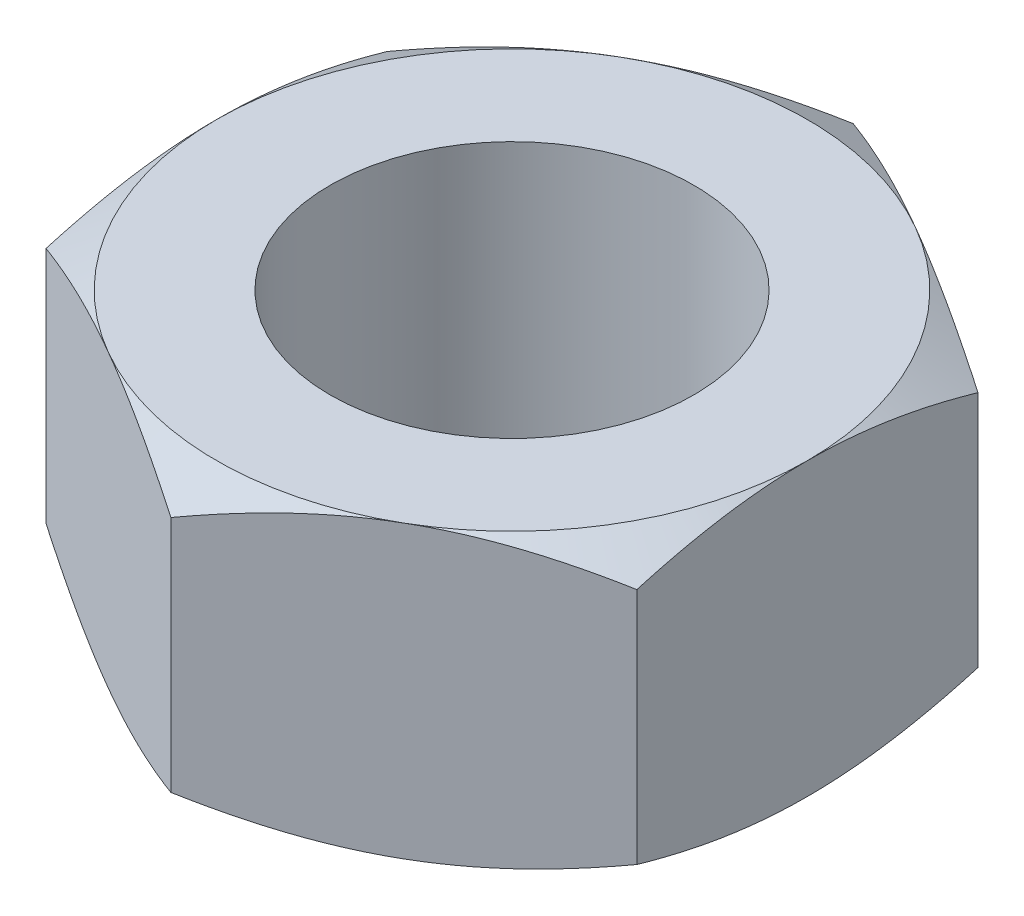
ISO-10303-21;
HEADER;
FILE_DESCRIPTION(('STEP AP214'),'2;1');
FILE_NAME('part.step','',(''),(''),'','','');
FILE_SCHEMA(('AUTOMOTIVE_DESIGN { 1 0 10303 214 1 1 1 1 }'));
ENDSEC;
DATA;
#1=APPLICATION_CONTEXT('core data for automotive mechanical design processes');
#2=APPLICATION_PROTOCOL_DEFINITION('international standard','automotive_design',2000,#1);
#3=PRODUCT_CONTEXT('',#1,'mechanical');
#4=PRODUCT('Part','Part','',(#3));
#5=PRODUCT_RELATED_PRODUCT_CATEGORY('part','',(#4));
#6=PRODUCT_DEFINITION_FORMATION('','',#4);
#7=PRODUCT_DEFINITION_CONTEXT('part definition',#1,'design');
#8=PRODUCT_DEFINITION('design','',#6,#7);
#9=PRODUCT_DEFINITION_SHAPE('','',#8);
#10=(LENGTH_UNIT() NAMED_UNIT(*) SI_UNIT(.MILLI.,.METRE.));
#11=(NAMED_UNIT(*) PLANE_ANGLE_UNIT() SI_UNIT($,.RADIAN.));
#12=(NAMED_UNIT(*) SI_UNIT($,.STERADIAN.) SOLID_ANGLE_UNIT());
#13=UNCERTAINTY_MEASURE_WITH_UNIT(LENGTH_MEASURE(1.E-05),#10,'distance_accuracy_value','');
#14=(GEOMETRIC_REPRESENTATION_CONTEXT(3) GLOBAL_UNCERTAINTY_ASSIGNED_CONTEXT((#13)) GLOBAL_UNIT_ASSIGNED_CONTEXT((#10,
#11,#12)) REPRESENTATION_CONTEXT('',''));
#15=CARTESIAN_POINT('',(0.,0.,0.));
#16=DIRECTION('',(0.,0.,1.));
#17=DIRECTION('',(1.,0.,0.));
#18=AXIS2_PLACEMENT_3D('',#15,#16,#17);
#19=CARTESIAN_POINT('',(0.,6.4,0.));
#20=DIRECTION('',(0.,-1.,0.));
#21=DIRECTION('',(0.,0.,-1.));
#22=AXIS2_PLACEMENT_3D('',#19,#20,#21);
#23=CONICAL_SURFACE('',#22,6.49999999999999,1.0471975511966);
#24=CARTESIAN_POINT('',(0.,6.4,0.));
#25=DIRECTION('',(0.,1.,0.));
#26=DIRECTION('',(0.,0.,1.));
#27=AXIS2_PLACEMENT_3D('',#24,#25,#26);
#28=CIRCLE('',#27,6.49999999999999);
#29=CARTESIAN_POINT('',(-3.24999999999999,6.4,-5.62916512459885));
#30=VERTEX_POINT('',#29);
#31=CARTESIAN_POINT('',(-6.5,6.4,0.));
#32=VERTEX_POINT('',#31);
#33=EDGE_CURVE('E145',#30,#32,#28,.T.);
#34=ORIENTED_EDGE('',*,*,#33,.F.);
#35=CARTESIAN_POINT('',(0.000200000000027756,5.81937674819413,-7.50566896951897));
#36=CARTESIAN_POINT('',(-0.142677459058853,5.86699557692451,-7.4231786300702));
#37=CARTESIAN_POINT('',(-0.286087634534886,5.91245329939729,-7.34038072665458));
#38=CARTESIAN_POINT('',(-0.574072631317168,5.99845131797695,-7.17411251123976));
#39=CARTESIAN_POINT('',(-0.718647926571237,6.03898949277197,-7.09064192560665));
#40=CARTESIAN_POINT('',(-1.15468865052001,6.15242899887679,-6.83889369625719));
#41=CARTESIAN_POINT('',(-1.44787528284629,6.21695219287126,-6.66962231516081));
#42=CARTESIAN_POINT('',(-1.88662374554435,6.29261341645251,-6.41631077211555));
#43=CARTESIAN_POINT('',(-2.03087463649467,6.31416714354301,-6.33302748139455));
#44=CARTESIAN_POINT('',(-2.32002821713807,6.35030968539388,-6.16608458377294));
#45=CARTESIAN_POINT('',(-2.46493084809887,6.36489911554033,-6.08242501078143));
#46=CARTESIAN_POINT('',(-2.7549877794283,6.38674124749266,-5.91496056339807));
#47=CARTESIAN_POINT('',(-2.90014160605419,6.39400227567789,-5.83115596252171));
#48=CARTESIAN_POINT('',(-3.19057533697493,6.40103969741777,-5.66347396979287));
#49=CARTESIAN_POINT('',(-3.33585523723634,6.4008163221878,-5.57959658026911));
#50=CARTESIAN_POINT('',(-3.73387594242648,6.38991654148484,-5.34979921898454));
#51=CARTESIAN_POINT('',(-3.98648646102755,6.37161818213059,-5.20395446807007));
#52=CARTESIAN_POINT('',(-4.49002967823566,6.31359365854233,-4.91323365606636));
#53=CARTESIAN_POINT('',(-4.74096060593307,6.27384766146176,-4.76835861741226));
#54=CARTESIAN_POINT('',(-5.24551722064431,6.17449409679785,-4.47705272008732));
#55=CARTESIAN_POINT('',(-5.49907924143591,6.11446557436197,-4.33065861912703));
#56=CARTESIAN_POINT('',(-6.00242193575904,5.97822500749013,-4.04005357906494));
#57=CARTESIAN_POINT('',(-6.25220905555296,5.9020449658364,-3.89583891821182));
#58=CARTESIAN_POINT('',(-6.5002,5.81937674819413,-3.75266127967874));
#59=B_SPLINE_CURVE_WITH_KNOTS('',3,(#35,#36,#37,#38,#39,#40,#41,#42,#43,#44,#45,#46,#47,#48,#49,
#50,#51,#52,#53,#54,#55,#56,#57,#58),.UNSPECIFIED.,.F.,.F.,(4,2,2,2,2,2,2,2,2,2,2,4),(0.,
0.515105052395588,1.03043143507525,2.06322554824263,2.56697389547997,3.07067772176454,
3.57380860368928,4.07692394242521,4.95279354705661,5.82947446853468,6.72559912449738,
7.61996451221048),.UNSPECIFIED.);
#60=CARTESIAN_POINT('',(-6.5,5.81944341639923,-3.75277674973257));
#61=VERTEX_POINT('',#60);
#62=EDGE_CURVE('E167',#30,#61,#59,.T.);
#63=ORIENTED_EDGE('',*,*,#62,.T.);
#64=CARTESIAN_POINT('',(-6.5,-1.73168432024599,-19.5312888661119));
#65=CARTESIAN_POINT('',(-6.5,-1.4966456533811,-19.1022078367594));
#66=CARTESIAN_POINT('',(-6.5,-1.26217643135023,-18.6728135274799));
#67=CARTESIAN_POINT('',(-6.5,-0.794676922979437,-17.8132347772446));
#68=CARTESIAN_POINT('',(-6.5,-0.561646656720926,-17.3830503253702));
#69=CARTESIAN_POINT('',(-6.5,-0.0971986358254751,-16.521492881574));
#70=CARTESIAN_POINT('',(-6.5,0.134218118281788,-16.0901193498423));
#71=CARTESIAN_POINT('',(-6.5,0.594879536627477,-15.2262161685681));
#72=CARTESIAN_POINT('',(-6.5,0.824124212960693,-14.7936865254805));
#73=CARTESIAN_POINT('',(-6.5,1.28560408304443,-13.91631497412));
#74=CARTESIAN_POINT('',(-6.5,1.51776990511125,-13.4714365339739));
#75=CARTESIAN_POINT('',(-6.5,1.97840703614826,-12.5797711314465));
#76=CARTESIAN_POINT('',(-6.5,2.20687837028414,-12.1329841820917));
#77=CARTESIAN_POINT('',(-6.5,2.65890746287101,-11.2370666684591));
#78=CARTESIAN_POINT('',(-6.5,2.88246642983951,-10.7879367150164));
#79=CARTESIAN_POINT('',(-6.5,3.32306396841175,-9.88649083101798));
#80=CARTESIAN_POINT('',(-6.5,3.54010276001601,-9.43417500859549));
#81=CARTESIAN_POINT('',(-6.5,3.86493666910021,-8.73959288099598));
#82=CARTESIAN_POINT('',(-6.5,3.97598724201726,-8.49884937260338));
#83=CARTESIAN_POINT('',(-6.5,4.19504629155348,-8.01598409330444));
#84=CARTESIAN_POINT('',(-6.5,4.30305482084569,-7.7738623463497));
#85=CARTESIAN_POINT('',(-6.5,4.51543794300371,-7.28793346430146));
#86=CARTESIAN_POINT('',(-6.5,4.61981135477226,-7.04412581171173));
#87=CARTESIAN_POINT('',(-6.5,4.82408998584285,-6.5546411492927));
#88=CARTESIAN_POINT('',(-6.5,4.92399522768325,-6.3089641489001));
#89=CARTESIAN_POINT('',(-6.5,5.1177530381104,-5.81692116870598));
#90=CARTESIAN_POINT('',(-6.5,5.21163822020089,-5.57056808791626));
#91=CARTESIAN_POINT('',(-6.5,5.39276680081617,-5.07540981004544));
#92=CARTESIAN_POINT('',(-6.5,5.48000993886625,-4.82660451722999));
#93=CARTESIAN_POINT('',(-6.5,5.64628709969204,-4.32633203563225));
#94=CARTESIAN_POINT('',(-6.5,5.72532385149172,-4.07486576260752));
#95=CARTESIAN_POINT('',(-6.5,5.8733538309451,-3.56902457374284));
#96=CARTESIAN_POINT('',(-6.5,5.9423482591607,-3.3146500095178));
#97=CARTESIAN_POINT('',(-6.5,6.09286933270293,-2.7022859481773));
#98=CARTESIAN_POINT('',(-6.5,6.16867912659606,-2.34283110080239));
#99=CARTESIAN_POINT('',(-6.5,6.26005263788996,-1.79997420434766));
#100=CARTESIAN_POINT('',(-6.5,6.28678595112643,-1.61842117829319));
#101=CARTESIAN_POINT('',(-6.5,6.33214270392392,-1.25431349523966));
#102=CARTESIAN_POINT('',(-6.5,6.35076724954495,-1.07175897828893));
#103=CARTESIAN_POINT('',(-6.5,6.37932032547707,-0.706738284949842));
#104=CARTESIAN_POINT('',(-6.5,6.38928503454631,-0.524274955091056));
#105=CARTESIAN_POINT('',(-6.5,6.40035260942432,-0.159079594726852));
#106=CARTESIAN_POINT('',(-6.49999999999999,6.40145560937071,0.0236524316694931));
#107=CARTESIAN_POINT('',(-6.49999999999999,6.39476456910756,0.388974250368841));
#108=CARTESIAN_POINT('',(-6.49999999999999,6.38696948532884,0.571564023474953));
#109=CARTESIAN_POINT('',(-6.49999999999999,6.36271981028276,0.936166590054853));
#110=CARTESIAN_POINT('',(-6.49999999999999,6.34626483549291,1.11817935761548));
#111=CARTESIAN_POINT('',(-6.49999999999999,6.29791455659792,1.54525292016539));
#112=CARTESIAN_POINT('',(-6.49999999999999,6.26262175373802,1.78993183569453));
#113=CARTESIAN_POINT('',(-6.49999999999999,6.17867090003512,2.27698296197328));
#114=CARTESIAN_POINT('',(-6.49999999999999,6.1300107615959,2.51935480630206));
#115=CARTESIAN_POINT('',(-6.49999999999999,6.02115869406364,3.00169016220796));
#116=CARTESIAN_POINT('',(-6.49999999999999,5.96095675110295,3.24165139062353));
#117=CARTESIAN_POINT('',(-6.49999999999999,5.83089363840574,3.71891050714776));
#118=CARTESIAN_POINT('',(-6.49999999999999,5.76103269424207,3.95620845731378));
#119=CARTESIAN_POINT('',(-6.49999999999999,5.61163566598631,4.43362654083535));
#120=CARTESIAN_POINT('',(-6.49999999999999,5.53191635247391,4.6736889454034));
#121=CARTESIAN_POINT('',(-6.49999999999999,5.36561577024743,5.15141149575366));
#122=CARTESIAN_POINT('',(-6.49999999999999,5.27903446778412,5.38907162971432));
#123=CARTESIAN_POINT('',(-6.49999999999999,5.10029080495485,5.86215143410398));
#124=CARTESIAN_POINT('',(-6.49999999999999,5.0081310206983,6.09757208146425));
#125=CARTESIAN_POINT('',(-6.49999999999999,4.86643002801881,6.44929602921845));
#126=CARTESIAN_POINT('',(-6.49999999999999,4.81862003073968,6.56630154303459));
#127=CARTESIAN_POINT('',(-6.49999999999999,4.72194822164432,6.79987674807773));
#128=CARTESIAN_POINT('',(-6.49999999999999,4.67308641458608,6.91644644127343));
#129=CARTESIAN_POINT('',(-6.49999999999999,4.50320382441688,7.31712551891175));
#130=CARTESIAN_POINT('',(-6.49999999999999,4.37981446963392,7.60023227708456));
#131=CARTESIAN_POINT('',(-6.49999999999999,4.12849982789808,8.16442941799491));
#132=CARTESIAN_POINT('',(-6.49999999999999,4.00057435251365,8.44551971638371));
#133=CARTESIAN_POINT('',(-6.49999999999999,3.7410485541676,9.00604342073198));
#134=CARTESIAN_POINT('',(-6.49999999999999,3.6094477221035,9.2854765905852));
#135=CARTESIAN_POINT('',(-6.49999999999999,3.34325963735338,9.84291853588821));
#136=CARTESIAN_POINT('',(-6.49999999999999,3.20867234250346,10.1209272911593));
#137=CARTESIAN_POINT('',(-6.49999999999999,2.80112259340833,10.9534229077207));
#138=CARTESIAN_POINT('',(-6.49999999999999,2.52449575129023,11.5061152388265));
#139=CARTESIAN_POINT('',(-6.49999999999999,1.96446976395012,12.6080583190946));
#140=CARTESIAN_POINT('',(-6.49999999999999,1.68107044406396,13.157308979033));
#141=CARTESIAN_POINT('',(-6.49999999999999,1.25202697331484,13.9797625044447));
#142=CARTESIAN_POINT('',(-6.49999999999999,1.10822162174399,14.2539269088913));
#143=CARTESIAN_POINT('',(-6.49999999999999,0.819547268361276,14.8016904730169));
#144=CARTESIAN_POINT('',(-6.49999999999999,0.674678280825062,15.0752896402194));
#145=CARTESIAN_POINT('',(-6.49999999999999,0.238692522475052,15.8953695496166));
#146=CARTESIAN_POINT('',(-6.49999999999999,-0.053796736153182,16.4411206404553));
#147=CARTESIAN_POINT('',(-6.49999999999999,-0.641457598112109,17.5309530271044));
#148=CARTESIAN_POINT('',(-6.49999999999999,-0.93662832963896,18.0750347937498));
#149=CARTESIAN_POINT('',(-6.49999999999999,-1.52913206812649,19.1620194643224));
#150=CARTESIAN_POINT('',(-6.49999999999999,-1.82646507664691,19.7049223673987));
#151=CARTESIAN_POINT('',(-6.49999999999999,-2.63508086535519,21.1759033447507));
#152=CARTESIAN_POINT('',(-6.49999999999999,-3.14800475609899,22.1030789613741));
#153=CARTESIAN_POINT('',(-6.49999999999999,-4.17735146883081,23.9555957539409));
#154=CARTESIAN_POINT('',(-6.49999999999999,-4.69377461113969,24.8809367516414));
#155=CARTESIAN_POINT('',(-6.49999999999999,-5.72743347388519,26.7272179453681));
#156=CARTESIAN_POINT('',(-6.49999999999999,-6.24466110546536,27.6481626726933));
#157=CARTESIAN_POINT('',(-6.49999999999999,-7.28095259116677,29.4888972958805));
#158=CARTESIAN_POINT('',(-6.49999999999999,-7.80001625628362,30.4086872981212));
#159=CARTESIAN_POINT('',(-6.49999999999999,-8.31972892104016,31.328108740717));
#160=B_SPLINE_CURVE_WITH_KNOTS('',3,(#64,#65,#66,#67,#68,#69,#70,#71,#72,#73,#74,#75,#76,#77,
#78,#79,#80,#81,#82,#83,#84,#85,#86,#87,#88,#89,#90,#91,#92,#93,#94,#95,#96,#97,#98,#99,#100,
#101,#102,#103,#104,#105,#106,#107,#108,#109,#110,#111,#112,#113,#114,#115,#116,#117,#118,#119,
#120,#121,#122,#123,#124,#125,#126,#127,#128,#129,#130,#131,#132,#133,#134,#135,#136,#137,#138,
#139,#140,#141,#142,#143,#144,#145,#146,#147,#148,#149,#150,#151,#152,#153,#154,#155,#156,#157,
#158,#159),.UNSPECIFIED.,.F.,.F.,(4,2,2,2,2,2,2,2,2,2,2,2,2,2,2,2,2,2,2,2,2,2,2,2,2,2,2,2,2,2,2,
2,2,2,2,2,2,2,2,2,2,2,2,2,2,2,2,4),(0.,1.4677149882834,2.93545041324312,4.40402688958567,
5.87259518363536,7.37802578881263,8.88344613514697,10.3884918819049,11.8934867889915,
12.6888363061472,13.4841720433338,14.2797638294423,15.0753516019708,15.8661832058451,
16.657045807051,17.4476445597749,18.2381487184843,19.3390534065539,19.8894354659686,
20.4397424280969,20.9877391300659,21.5357275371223,22.0837802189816,22.6318571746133,
23.3730479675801,24.1143545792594,24.8563072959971,25.5982426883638,26.3569746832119,
27.1157104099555,27.8740983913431,28.2532839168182,28.6324677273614,29.5588929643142,
30.4853567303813,31.4119494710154,32.3385553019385,34.1926408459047,36.0467742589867,
36.9755428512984,37.9042990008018,39.7618521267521,41.6188215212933,43.4757922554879,
46.6545709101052,49.8336445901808,53.0023914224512,56.1708210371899),.UNSPECIFIED.);
#161=EDGE_CURVE('E172',#61,#32,#160,.T.);
#162=ORIENTED_EDGE('',*,*,#161,.T.);
#163=EDGE_LOOP('',(#34,#63,#162));
#164=FACE_BOUND('',#163,.T.);
#165=ADVANCED_FACE('F32',(#164),#23,.T.);
#166=CARTESIAN_POINT('',(6.50019999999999,5.81937674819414,-3.75266127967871));
#167=CARTESIAN_POINT('',(6.35732254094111,5.86699557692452,-3.83515161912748));
#168=CARTESIAN_POINT('',(6.21391236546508,5.9124532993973,-3.9179495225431));
#169=CARTESIAN_POINT('',(5.9259273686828,5.99845131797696,-4.08421773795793));
#170=CARTESIAN_POINT('',(5.78135207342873,6.03898949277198,-4.16768832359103));
#171=CARTESIAN_POINT('',(5.34531134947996,6.1524289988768,-4.4194365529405));
#172=CARTESIAN_POINT('',(5.05212471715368,6.21695219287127,-4.58870793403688));
#173=CARTESIAN_POINT('',(4.61337625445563,6.29261341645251,-4.84201947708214));
#174=CARTESIAN_POINT('',(4.46912536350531,6.31416714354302,-4.92530276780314));
#175=CARTESIAN_POINT('',(4.17997178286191,6.35030968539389,-5.09224566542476));
#176=CARTESIAN_POINT('',(4.03506915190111,6.36489911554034,-5.17590523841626));
#177=CARTESIAN_POINT('',(3.74501222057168,6.38674124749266,-5.34336968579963));
#178=CARTESIAN_POINT('',(3.59985839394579,6.3940022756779,-5.42717428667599));
#179=CARTESIAN_POINT('',(3.30942466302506,6.40103969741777,-5.59485627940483));
#180=CARTESIAN_POINT('',(3.16414476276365,6.4008163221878,-5.67873366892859));
#181=CARTESIAN_POINT('',(2.76612405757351,6.38991654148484,-5.90853103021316));
#182=CARTESIAN_POINT('',(2.51351353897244,6.37161818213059,-6.05437578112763));
#183=CARTESIAN_POINT('',(2.00997032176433,6.31359365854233,-6.34509659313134));
#184=CARTESIAN_POINT('',(1.75903939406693,6.27384766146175,-6.48997163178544));
#185=CARTESIAN_POINT('',(1.2544827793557,6.17449409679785,-6.78127752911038));
#186=CARTESIAN_POINT('',(1.00092075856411,6.11446557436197,-6.92767163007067));
#187=CARTESIAN_POINT('',(0.497578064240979,5.97822500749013,-7.21827667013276));
#188=CARTESIAN_POINT('',(0.247790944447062,5.9020449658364,-7.36249133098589));
#189=CARTESIAN_POINT('',(-0.000199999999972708,5.81937674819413,-7.50566896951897));
#190=B_SPLINE_CURVE_WITH_KNOTS('',3,(#166,#167,#168,#169,#170,#171,#172,#173,#174,#175,#176,
#177,#178,#179,#180,#181,#182,#183,#184,#185,#186,#187,#188,#189),.UNSPECIFIED.,.F.,.F.,(4,2,2,
2,2,2,2,2,2,2,2,4),(0.,0.515105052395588,1.03043143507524,2.06322554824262,2.56697389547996,
3.07067772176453,3.57380860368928,4.0769239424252,4.95279354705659,5.82947446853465,
6.72559912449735,7.61996451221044),.UNSPECIFIED.);
#191=CARTESIAN_POINT('',(3.25000000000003,6.4,-5.62916512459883));
#192=VERTEX_POINT('',#191);
#193=CARTESIAN_POINT('',(0.,5.81944341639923,-7.50555349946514));
#194=VERTEX_POINT('',#193);
#195=EDGE_CURVE('E162',#192,#194,#190,.T.);
#196=ORIENTED_EDGE('',*,*,#195,.T.);
#197=EDGE_CURVE('E163',#194,#30,#59,.T.);
#198=ORIENTED_EDGE('',*,*,#197,.T.);
#199=EDGE_CURVE('E152',#192,#30,#28,.T.);
#200=ORIENTED_EDGE('',*,*,#199,.F.);
#201=EDGE_LOOP('',(#196,#198,#200));
#202=FACE_BOUND('',#201,.T.);
#203=ADVANCED_FACE('F161',(#202),#23,.T.);
#204=CARTESIAN_POINT('',(6.49999999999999,-1.73168407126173,-19.5312884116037));
#205=CARTESIAN_POINT('',(6.49999999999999,-1.49664541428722,-19.1022073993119));
#206=CARTESIAN_POINT('',(6.49999999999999,-1.26217620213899,-18.6728131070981));
#207=CARTESIAN_POINT('',(6.49999999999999,-0.794676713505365,-17.8132343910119));
#208=CARTESIAN_POINT('',(6.49999999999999,-0.561646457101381,-17.3830499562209));
#209=CARTESIAN_POINT('',(6.49999999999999,-0.0971984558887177,-16.5214925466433));
#210=CARTESIAN_POINT('',(6.49999999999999,0.134218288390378,-16.0901190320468));
#211=CARTESIAN_POINT('',(6.49999999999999,0.59487968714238,-15.2262158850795));
#212=CARTESIAN_POINT('',(6.49999999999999,0.824124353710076,-14.7936862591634));
#213=CARTESIAN_POINT('',(6.49999999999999,1.28560420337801,-13.9163147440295));
#214=CARTESIAN_POINT('',(6.49999999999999,1.51777001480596,-13.4714363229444));
#215=CARTESIAN_POINT('',(6.49999999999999,1.97840712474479,-12.5797709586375));
#216=CARTESIAN_POINT('',(6.49999999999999,2.20687844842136,-12.1329840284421));
#217=CARTESIAN_POINT('',(6.49999999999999,2.65890752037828,-11.2370665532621));
#218=CARTESIAN_POINT('',(6.49999999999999,2.88246647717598,-10.7879366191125));
#219=CARTESIAN_POINT('',(6.49999999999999,3.32306399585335,-9.88649077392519));
#220=CARTESIAN_POINT('',(6.49999999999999,3.5401027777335,-9.43417497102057));
#221=CARTESIAN_POINT('',(6.49999999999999,3.86493667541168,-8.73959286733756));
#222=CARTESIAN_POINT('',(6.49999999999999,3.97598724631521,-8.49884936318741));
#223=CARTESIAN_POINT('',(6.49999999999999,4.19504629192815,-8.0159840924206));
#224=CARTESIAN_POINT('',(6.49999999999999,4.3030548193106,-7.77386234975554));
#225=CARTESIAN_POINT('',(6.49999999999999,4.51543793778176,-7.28793347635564));
#226=CARTESIAN_POINT('',(6.49999999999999,4.61981134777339,-7.04412582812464));
#227=CARTESIAN_POINT('',(6.49999999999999,4.82408997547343,-6.55464117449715));
#228=CARTESIAN_POINT('',(6.49999999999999,4.92399521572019,-6.30896417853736));
#229=CARTESIAN_POINT('',(6.49999999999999,5.11775302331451,-5.81692120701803));
#230=CARTESIAN_POINT('',(6.49999999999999,5.21163820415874,-5.57056813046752));
#231=CARTESIAN_POINT('',(6.49999999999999,5.39276678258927,-5.07540986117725));
#232=CARTESIAN_POINT('',(6.49999999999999,5.48000991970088,-4.82660457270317));
#233=CARTESIAN_POINT('',(6.49999999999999,5.64628707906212,-4.32633209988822));
#234=CARTESIAN_POINT('',(6.49999999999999,5.72532383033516,-4.07486583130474));
#235=CARTESIAN_POINT('',(6.49999999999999,5.87335380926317,-3.5690246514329));
#236=CARTESIAN_POINT('',(6.49999999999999,5.94234823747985,-3.3146500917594));
#237=CARTESIAN_POINT('',(6.49999999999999,6.09286931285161,-2.702286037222));
#238=CARTESIAN_POINT('',(6.49999999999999,6.16867910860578,-2.34283119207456));
#239=CARTESIAN_POINT('',(6.49999999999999,6.26005262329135,-1.79997429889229));
#240=CARTESIAN_POINT('',(6.49999999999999,6.28678593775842,-1.61842127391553));
#241=CARTESIAN_POINT('',(6.49999999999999,6.33214269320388,-1.25431359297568));
#242=CARTESIAN_POINT('',(6.49999999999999,6.35076724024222,-1.07175907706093));
#243=CARTESIAN_POINT('',(6.49999999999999,6.37932031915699,-0.706738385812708));
#244=CARTESIAN_POINT('',(6.49999999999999,6.3892850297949,-0.524275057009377));
#245=CARTESIAN_POINT('',(6.49999999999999,6.40035260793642,-0.15907969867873));
#246=CARTESIAN_POINT('',(6.49999999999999,6.40145560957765,0.0236523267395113));
#247=CARTESIAN_POINT('',(6.49999999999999,6.39476457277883,0.388974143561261));
#248=CARTESIAN_POINT('',(6.49999999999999,6.38696949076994,0.571563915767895));
#249=CARTESIAN_POINT('',(6.49999999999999,6.36271981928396,0.936166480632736));
#250=CARTESIAN_POINT('',(6.49999999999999,6.34626484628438,1.11817924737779));
#251=CARTESIAN_POINT('',(6.49999999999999,6.29791457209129,1.54525280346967));
#252=CARTESIAN_POINT('',(6.49999999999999,6.26262177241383,1.78993171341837));
#253=CARTESIAN_POINT('',(6.49999999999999,6.17867092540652,2.27698282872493));
#254=CARTESIAN_POINT('',(6.49999999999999,6.13001079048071,2.51935466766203));
#255=CARTESIAN_POINT('',(6.49999999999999,6.02115873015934,3.00169001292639));
#256=CARTESIAN_POINT('',(6.49999999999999,5.96095679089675,3.24165123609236));
#257=CARTESIAN_POINT('',(6.49999999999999,5.83089368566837,3.71891034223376));
#258=CARTESIAN_POINT('',(6.49999999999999,5.76103274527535,3.95620828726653));
#259=CARTESIAN_POINT('',(6.49999999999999,5.61163572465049,4.43362636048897));
#260=CARTESIAN_POINT('',(6.49999999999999,5.53191641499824,4.67368875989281));
#261=CARTESIAN_POINT('',(6.49999999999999,5.36561584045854,5.15141129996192));
#262=CARTESIAN_POINT('',(6.5,5.27903454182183,5.38907142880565));
#263=CARTESIAN_POINT('',(6.5,5.10029088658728,5.86215122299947));
#264=CARTESIAN_POINT('',(6.5,5.00813110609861,6.09757186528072));
#265=CARTESIAN_POINT('',(6.5,4.86643011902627,6.44929580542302));
#266=CARTESIAN_POINT('',(6.5,4.81862012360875,6.56630131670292));
#267=CARTESIAN_POINT('',(6.5,4.72194831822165,6.7998765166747));
#268=CARTESIAN_POINT('',(6.5,4.67308651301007,6.91644620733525));
#269=CARTESIAN_POINT('',(6.5,4.50320393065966,7.31712527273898));
#270=CARTESIAN_POINT('',(6.5,4.37981458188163,7.60023202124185));
#271=CARTESIAN_POINT('',(6.5,4.12849995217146,8.16442914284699));
#272=CARTESIAN_POINT('',(6.5,4.00057448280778,8.44551943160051));
#273=CARTESIAN_POINT('',(6.5,3.74104869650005,9.00604311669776));
#274=CARTESIAN_POINT('',(6.5,3.6094478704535,9.28547627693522));
#275=CARTESIAN_POINT('',(6.5,3.34325979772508,9.84291820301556));
#276=CARTESIAN_POINT('',(6.5,3.2086725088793,10.1209269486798));
#277=CARTESIAN_POINT('',(6.5,2.80112277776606,10.9534225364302));
#278=CARTESIAN_POINT('',(6.5,2.52449594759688,11.5061148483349));
#279=CARTESIAN_POINT('',(6.5,1.9644699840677,12.6080578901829));
#280=CARTESIAN_POINT('',(6.5,1.68107067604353,13.1573085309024));
#281=CARTESIAN_POINT('',(6.5,1.25202722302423,13.9797620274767));
#282=CARTESIAN_POINT('',(6.5,1.10822187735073,14.2539264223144));
#283=CARTESIAN_POINT('',(6.5,0.819547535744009,14.8016899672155));
#284=CARTESIAN_POINT('',(6.5,0.67467855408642,15.0752891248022));
#285=CARTESIAN_POINT('',(6.5,0.238692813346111,15.8953690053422));
#286=CARTESIAN_POINT('',(6.5,-0.0537964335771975,16.4411200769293));
#287=CARTESIAN_POINT('',(6.5,-0.641457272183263,17.5309524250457));
#288=CARTESIAN_POINT('',(6.5,-0.936627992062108,18.0750341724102));
#289=CARTESIAN_POINT('',(6.5,-1.52913170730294,19.1620188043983));
#290=CARTESIAN_POINT('',(6.5,-1.82646470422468,19.7049216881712));
#291=CARTESIAN_POINT('',(6.5,-2.63508046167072,21.1759026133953));
#292=CARTESIAN_POINT('',(6.5,-3.14800433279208,22.1030781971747));
#293=CARTESIAN_POINT('',(6.5,-4.17735100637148,23.9555949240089));
#294=CARTESIAN_POINT('',(6.5,-4.69377412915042,24.8809358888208));
#295=CARTESIAN_POINT('',(6.5,-5.7274329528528,26.7272170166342));
#296=CARTESIAN_POINT('',(6.5,-6.24466056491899,27.6481617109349));
#297=CARTESIAN_POINT('',(6.5,-7.28095201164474,29.4888962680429));
#298=CARTESIAN_POINT('',(6.5,-7.80001565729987,30.4086862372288));
#299=CARTESIAN_POINT('',(6.5,-8.31972830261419,31.3281076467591));
#300=B_SPLINE_CURVE_WITH_KNOTS('',3,(#204,#205,#206,#207,#208,#209,#210,#211,#212,#213,#214,
#215,#216,#217,#218,#219,#220,#221,#222,#223,#224,#225,#226,#227,#228,#229,#230,#231,#232,#233,
#234,#235,#236,#237,#238,#239,#240,#241,#242,#243,#244,#245,#246,#247,#248,#249,#250,#251,#252,
#253,#254,#255,#256,#257,#258,#259,#260,#261,#262,#263,#264,#265,#266,#267,#268,#269,#270,#271,
#272,#273,#274,#275,#276,#277,#278,#279,#280,#281,#282,#283,#284,#285,#286,#287,#288,#289,#290,
#291,#292,#293,#294,#295,#296,#297,#298,#299),.UNSPECIFIED.,.F.,.F.,(4,2,2,2,2,2,2,2,2,2,2,2,2,
2,2,2,2,2,2,2,2,2,2,2,2,2,2,2,2,2,2,2,2,2,2,2,2,2,2,2,2,2,2,2,2,2,2,4),(0.,1.4677149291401,
2.93545029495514,4.4040267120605,5.87259494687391,7.37802548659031,8.88344576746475,
10.3884914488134,11.8934862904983,12.6888357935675,13.4841715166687,14.2797632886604,
15.0753510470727,15.8661826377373,16.65704522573,17.4476439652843,18.2381481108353,
19.3390527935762,19.8894348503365,20.4397418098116,20.9877385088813,21.535726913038,
22.0837795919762,22.6318565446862,23.3730473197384,24.1143539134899,24.8563066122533,
25.5982419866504,26.3569739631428,27.1157096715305,27.8740976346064,28.2532831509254,
28.6324669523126,29.558892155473,30.4853558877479,31.4119485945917,32.3385543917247,
34.1926398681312,36.0467732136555,36.975541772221,37.9042978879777,39.7618509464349,
41.6188202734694,43.4757909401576,46.6545694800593,49.8336430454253,53.0023897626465,
56.1708192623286),.UNSPECIFIED.);
#301=CARTESIAN_POINT('',(6.49999999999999,6.4,0.));
#302=VERTEX_POINT('',#301);
#303=CARTESIAN_POINT('',(6.49999999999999,5.81944341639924,-3.75277674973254));
#304=VERTEX_POINT('',#303);
#305=EDGE_CURVE('E287',#302,#304,#300,.F.);
#306=ORIENTED_EDGE('',*,*,#305,.T.);
#307=EDGE_CURVE('E244',#304,#192,#190,.T.);
#308=ORIENTED_EDGE('',*,*,#307,.T.);
#309=EDGE_CURVE('E151',#302,#192,#28,.T.);
#310=ORIENTED_EDGE('',*,*,#309,.F.);
#311=EDGE_LOOP('',(#306,#308,#310));
#312=FACE_BOUND('',#311,.T.);
#313=ADVANCED_FACE('F345',(#312),#23,.T.);
#314=CARTESIAN_POINT('',(3.24999999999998,6.4,5.62916512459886));
#315=VERTEX_POINT('',#314);
#316=EDGE_CURVE('E143',#315,#302,#28,.T.);
#317=ORIENTED_EDGE('',*,*,#316,.F.);
#318=CARTESIAN_POINT('',(-0.000200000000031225,5.81937674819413,7.50566896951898));
#319=CARTESIAN_POINT('',(0.142677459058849,5.86699557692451,7.4231786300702));
#320=CARTESIAN_POINT('',(0.286087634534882,5.91245329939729,7.34038072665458));
#321=CARTESIAN_POINT('',(0.574072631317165,5.99845131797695,7.17411251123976));
#322=CARTESIAN_POINT('',(0.718647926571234,6.03898949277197,7.09064192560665));
#323=CARTESIAN_POINT('',(1.15468865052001,6.15242899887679,6.83889369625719));
#324=CARTESIAN_POINT('',(1.44787528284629,6.21695219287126,6.66962231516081));
#325=CARTESIAN_POINT('',(1.88662374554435,6.29261341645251,6.41631077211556));
#326=CARTESIAN_POINT('',(2.03087463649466,6.31416714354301,6.33302748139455));
#327=CARTESIAN_POINT('',(2.32002821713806,6.35030968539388,6.16608458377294));
#328=CARTESIAN_POINT('',(2.46493084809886,6.36489911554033,6.08242501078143));
#329=CARTESIAN_POINT('',(2.7549877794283,6.38674124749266,5.91496056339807));
#330=CARTESIAN_POINT('',(2.90014160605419,6.3940022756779,5.83115596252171));
#331=CARTESIAN_POINT('',(3.19057533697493,6.40103969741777,5.66347396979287));
#332=CARTESIAN_POINT('',(3.33585523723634,6.4008163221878,5.57959658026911));
#333=CARTESIAN_POINT('',(3.73387594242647,6.38991654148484,5.34979921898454));
#334=CARTESIAN_POINT('',(3.98648646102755,6.37161818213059,5.20395446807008));
#335=CARTESIAN_POINT('',(4.49002967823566,6.31359365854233,4.91323365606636));
#336=CARTESIAN_POINT('',(4.74096060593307,6.27384766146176,4.76835861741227));
#337=CARTESIAN_POINT('',(5.24551722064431,6.17449409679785,4.47705272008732));
#338=CARTESIAN_POINT('',(5.4990792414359,6.11446557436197,4.33065861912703));
#339=CARTESIAN_POINT('',(6.00242193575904,5.97822500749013,4.04005357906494));
#340=CARTESIAN_POINT('',(6.25220905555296,5.9020449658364,3.89583891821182));
#341=CARTESIAN_POINT('',(6.50019999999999,5.81937674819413,3.75266127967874));
#342=B_SPLINE_CURVE_WITH_KNOTS('',3,(#318,#319,#320,#321,#322,#323,#324,#325,#326,#327,#328,
#329,#330,#331,#332,#333,#334,#335,#336,#337,#338,#339,#340,#341),.UNSPECIFIED.,.F.,.F.,(4,2,2,
2,2,2,2,2,2,2,2,4),(0.,0.515105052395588,1.03043143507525,2.06322554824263,2.56697389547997,
3.07067772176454,3.57380860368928,4.07692394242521,4.95279354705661,5.82947446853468,
6.72559912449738,7.61996451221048),.UNSPECIFIED.);
#343=CARTESIAN_POINT('',(6.49999999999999,5.81944341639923,3.75277674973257));
#344=VERTEX_POINT('',#343);
#345=EDGE_CURVE('E268',#315,#344,#342,.T.);
#346=ORIENTED_EDGE('',*,*,#345,.T.);
#347=EDGE_CURVE('E292',#344,#302,#300,.F.);
#348=ORIENTED_EDGE('',*,*,#347,.T.);
#349=EDGE_LOOP('',(#317,#346,#348));
#350=FACE_BOUND('',#349,.T.);
#351=ADVANCED_FACE('F350',(#350),#23,.T.);
#352=CARTESIAN_POINT('',(-6.5002,5.81937674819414,3.75266127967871));
#353=CARTESIAN_POINT('',(-6.35732254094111,5.86699557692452,3.83515161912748));
#354=CARTESIAN_POINT('',(-6.21391236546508,5.9124532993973,3.9179495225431));
#355=CARTESIAN_POINT('',(-5.9259273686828,5.99845131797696,4.08421773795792));
#356=CARTESIAN_POINT('',(-5.78135207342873,6.03898949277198,4.16768832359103));
#357=CARTESIAN_POINT('',(-5.34531134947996,6.1524289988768,4.4194365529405));
#358=CARTESIAN_POINT('',(-5.05212471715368,6.21695219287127,4.58870793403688));
#359=CARTESIAN_POINT('',(-4.61337625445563,6.29261341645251,4.84201947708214));
#360=CARTESIAN_POINT('',(-4.46912536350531,6.31416714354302,4.92530276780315));
#361=CARTESIAN_POINT('',(-4.17997178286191,6.35030968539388,5.09224566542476));
#362=CARTESIAN_POINT('',(-4.03506915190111,6.36489911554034,5.17590523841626));
#363=CARTESIAN_POINT('',(-3.74501222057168,6.38674124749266,5.34336968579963));
#364=CARTESIAN_POINT('',(-3.59985839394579,6.3940022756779,5.42717428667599));
#365=CARTESIAN_POINT('',(-3.30942466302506,6.40103969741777,5.59485627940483));
#366=CARTESIAN_POINT('',(-3.16414476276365,6.4008163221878,5.67873366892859));
#367=CARTESIAN_POINT('',(-2.76612405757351,6.38991654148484,5.90853103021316));
#368=CARTESIAN_POINT('',(-2.51351353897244,6.37161818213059,6.05437578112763));
#369=CARTESIAN_POINT('',(-2.00997032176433,6.31359365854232,6.34509659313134));
#370=CARTESIAN_POINT('',(-1.75903939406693,6.27384766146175,6.48997163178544));
#371=CARTESIAN_POINT('',(-1.25448277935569,6.17449409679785,6.78127752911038));
#372=CARTESIAN_POINT('',(-1.00092075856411,6.11446557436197,6.92767163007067));
#373=CARTESIAN_POINT('',(-0.497578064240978,5.97822500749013,7.21827667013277));
#374=CARTESIAN_POINT('',(-0.247790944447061,5.9020449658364,7.36249133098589));
#375=CARTESIAN_POINT('',(0.000199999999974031,5.81937674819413,7.50566896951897));
#376=B_SPLINE_CURVE_WITH_KNOTS('',3,(#352,#353,#354,#355,#356,#357,#358,#359,#360,#361,#362,
#363,#364,#365,#366,#367,#368,#369,#370,#371,#372,#373,#374,#375),.UNSPECIFIED.,.F.,.F.,(4,2,2,
2,2,2,2,2,2,2,2,4),(0.,0.515105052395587,1.03043143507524,2.06322554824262,2.56697389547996,
3.07067772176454,3.57380860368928,4.0769239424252,4.9527935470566,5.82947446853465,
6.72559912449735,7.61996451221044),.UNSPECIFIED.);
#377=CARTESIAN_POINT('',(-3.25000000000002,6.4,5.62916512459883));
#378=VERTEX_POINT('',#377);
#379=CARTESIAN_POINT('',(0.,5.81944341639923,7.50555349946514));
#380=VERTEX_POINT('',#379);
#381=EDGE_CURVE('E120',#378,#380,#376,.T.);
#382=ORIENTED_EDGE('',*,*,#381,.T.);
#383=EDGE_CURVE('E140',#380,#315,#342,.T.);
#384=ORIENTED_EDGE('',*,*,#383,.T.);
#385=EDGE_CURVE('E138',#378,#315,#28,.T.);
#386=ORIENTED_EDGE('',*,*,#385,.F.);
#387=EDGE_LOOP('',(#382,#384,#386));
#388=FACE_BOUND('',#387,.T.);
#389=ADVANCED_FACE('F139',(#388),#23,.T.);
#390=CARTESIAN_POINT('',(-6.49999999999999,5.81944341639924,3.75277674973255));
#391=VERTEX_POINT('',#390);
#392=EDGE_CURVE('E135',#32,#391,#160,.T.);
#393=ORIENTED_EDGE('',*,*,#392,.T.);
#394=EDGE_CURVE('E47',#391,#378,#376,.T.);
#395=ORIENTED_EDGE('',*,*,#394,.T.);
#396=EDGE_CURVE('E133',#32,#378,#28,.T.);
#397=ORIENTED_EDGE('',*,*,#396,.F.);
#398=EDGE_LOOP('',(#393,#395,#397));
#399=FACE_BOUND('',#398,.T.);
#400=ADVANCED_FACE('F131',(#399),#23,.T.);
#401=CARTESIAN_POINT('',(0.,2.59807621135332,0.));
#402=DIRECTION('',(0.,1.,0.));
#403=DIRECTION('',(0.,0.,1.));
#404=AXIS2_PLACEMENT_3D('',#401,#402,#403);
#405=CONICAL_SURFACE('',#404,11.,1.0471975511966);
#406=CARTESIAN_POINT('',(6.49999999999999,8.13168407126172,-19.5312884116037));
#407=CARTESIAN_POINT('',(6.49999999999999,7.89664541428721,-19.1022073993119));
#408=CARTESIAN_POINT('',(6.49999999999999,7.66217620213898,-18.6728131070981));
#409=CARTESIAN_POINT('',(6.49999999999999,7.19467671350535,-17.8132343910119));
#410=CARTESIAN_POINT('',(6.49999999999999,6.96164645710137,-17.3830499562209));
#411=CARTESIAN_POINT('',(6.49999999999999,6.49719845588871,-16.5214925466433));
#412=CARTESIAN_POINT('',(6.49999999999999,6.26578171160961,-16.0901190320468));
#413=CARTESIAN_POINT('',(6.49999999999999,5.80512031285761,-15.2262158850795));
#414=CARTESIAN_POINT('',(6.49999999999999,5.57587564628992,-14.7936862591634));
#415=CARTESIAN_POINT('',(6.49999999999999,5.11439579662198,-13.9163147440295));
#416=CARTESIAN_POINT('',(6.49999999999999,4.88222998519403,-13.4714363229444));
#417=CARTESIAN_POINT('',(6.49999999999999,4.4215928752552,-12.5797709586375));
#418=CARTESIAN_POINT('',(6.49999999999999,4.19312155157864,-12.1329840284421));
#419=CARTESIAN_POINT('',(6.49999999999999,3.74109247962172,-11.2370665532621));
#420=CARTESIAN_POINT('',(6.49999999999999,3.51753352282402,-10.7879366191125));
#421=CARTESIAN_POINT('',(6.49999999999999,3.07693600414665,-9.88649077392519));
#422=CARTESIAN_POINT('',(6.49999999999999,2.8598972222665,-9.43417497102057));
#423=CARTESIAN_POINT('',(6.49999999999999,2.53506332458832,-8.73959286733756));
#424=CARTESIAN_POINT('',(6.49999999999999,2.42401275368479,-8.49884936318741));
#425=CARTESIAN_POINT('',(6.49999999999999,2.20495370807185,-8.0159840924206));
#426=CARTESIAN_POINT('',(6.49999999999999,2.0969451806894,-7.77386234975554));
#427=CARTESIAN_POINT('',(6.49999999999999,1.88456206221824,-7.28793347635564));
#428=CARTESIAN_POINT('',(6.49999999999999,1.78018865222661,-7.04412582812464));
#429=CARTESIAN_POINT('',(6.49999999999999,1.57591002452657,-6.55464117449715));
#430=CARTESIAN_POINT('',(6.49999999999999,1.47600478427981,-6.30896417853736));
#431=CARTESIAN_POINT('',(6.49999999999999,1.28224697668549,-5.81692120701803));
#432=CARTESIAN_POINT('',(6.49999999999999,1.18836179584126,-5.57056813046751));
#433=CARTESIAN_POINT('',(6.49999999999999,1.00723321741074,-5.07540986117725));
#434=CARTESIAN_POINT('',(6.49999999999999,0.919990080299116,-4.82660457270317));
#435=CARTESIAN_POINT('',(6.49999999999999,0.753712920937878,-4.32633209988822));
#436=CARTESIAN_POINT('',(6.49999999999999,0.674676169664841,-4.07486583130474));
#437=CARTESIAN_POINT('',(6.49999999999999,0.526646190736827,-3.5690246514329));
#438=CARTESIAN_POINT('',(6.49999999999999,0.45765176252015,-3.31465009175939));
#439=CARTESIAN_POINT('',(6.49999999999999,0.307130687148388,-2.70228603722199));
#440=CARTESIAN_POINT('',(6.49999999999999,0.231320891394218,-2.34283119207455));
#441=CARTESIAN_POINT('',(6.49999999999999,0.139947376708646,-1.79997429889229));
#442=CARTESIAN_POINT('',(6.49999999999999,0.113214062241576,-1.61842127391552));
#443=CARTESIAN_POINT('',(6.49999999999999,0.0678573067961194,-1.25431359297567));
#444=CARTESIAN_POINT('',(6.49999999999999,0.0492327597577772,-1.07175907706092));
#445=CARTESIAN_POINT('',(6.49999999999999,0.0206796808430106,-0.706738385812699));
#446=CARTESIAN_POINT('',(6.49999999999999,0.0107149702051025,-0.524275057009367));
#447=CARTESIAN_POINT('',(6.49999999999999,-0.000352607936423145,-0.15907969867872));
#448=CARTESIAN_POINT('',(6.49999999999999,-0.00145560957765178,0.0236523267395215));
#449=CARTESIAN_POINT('',(6.49999999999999,0.00523542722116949,0.388974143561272));
#450=CARTESIAN_POINT('',(6.49999999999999,0.0130305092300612,0.571563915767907));
#451=CARTESIAN_POINT('',(6.49999999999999,0.0372801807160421,0.936166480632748));
#452=CARTESIAN_POINT('',(6.49999999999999,0.0537351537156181,1.1181792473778));
#453=CARTESIAN_POINT('',(6.49999999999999,0.102085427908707,1.54525280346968));
#454=CARTESIAN_POINT('',(6.49999999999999,0.137378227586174,1.78993171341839));
#455=CARTESIAN_POINT('',(6.49999999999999,0.221329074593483,2.27698282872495));
#456=CARTESIAN_POINT('',(6.49999999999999,0.269989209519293,2.51935466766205));
#457=CARTESIAN_POINT('',(6.49999999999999,0.378841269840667,3.00169001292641));
#458=CARTESIAN_POINT('',(6.49999999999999,0.439043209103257,3.24165123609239));
#459=CARTESIAN_POINT('',(6.49999999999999,0.569106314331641,3.71891034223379));
#460=CARTESIAN_POINT('',(6.49999999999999,0.638967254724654,3.95620828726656));
#461=CARTESIAN_POINT('',(6.49999999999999,0.788364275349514,4.433626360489));
#462=CARTESIAN_POINT('',(6.49999999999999,0.868083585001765,4.67368875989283));
#463=CARTESIAN_POINT('',(6.49999999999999,1.03438415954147,5.15141129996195));
#464=CARTESIAN_POINT('',(6.5,1.12096545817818,5.38907142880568));
#465=CARTESIAN_POINT('',(6.5,1.29970911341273,5.8621512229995));
#466=CARTESIAN_POINT('',(6.5,1.39186889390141,6.09757186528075));
#467=CARTESIAN_POINT('',(6.5,1.53356988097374,6.44929580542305));
#468=CARTESIAN_POINT('',(6.5,1.58137987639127,6.56630131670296));
#469=CARTESIAN_POINT('',(6.5,1.67805168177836,6.79987651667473));
#470=CARTESIAN_POINT('',(6.5,1.72691348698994,6.91644620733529));
#471=CARTESIAN_POINT('',(6.5,1.89679606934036,7.31712527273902));
#472=CARTESIAN_POINT('',(6.5,2.02018541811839,7.60023202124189));
#473=CARTESIAN_POINT('',(6.5,2.27150004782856,8.16442914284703));
#474=CARTESIAN_POINT('',(6.5,2.39942551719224,8.44551943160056));
#475=CARTESIAN_POINT('',(6.5,2.65895130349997,9.00604311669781));
#476=CARTESIAN_POINT('',(6.5,2.79055212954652,9.28547627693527));
#477=CARTESIAN_POINT('',(6.5,3.05674020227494,9.84291820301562));
#478=CARTESIAN_POINT('',(6.5,3.19132749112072,10.1209269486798));
#479=CARTESIAN_POINT('',(6.5,3.59887722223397,10.9534225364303));
#480=CARTESIAN_POINT('',(6.5,3.87550405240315,11.506114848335));
#481=CARTESIAN_POINT('',(6.5,4.43553001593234,12.608057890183));
#482=CARTESIAN_POINT('',(6.5,4.7189293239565,13.1573085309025));
#483=CARTESIAN_POINT('',(6.5,5.14797277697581,13.9797620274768));
#484=CARTESIAN_POINT('',(6.5,5.2917781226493,14.2539264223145));
#485=CARTESIAN_POINT('',(6.5,5.58045246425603,14.8016899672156));
#486=CARTESIAN_POINT('',(6.5,5.72532144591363,15.0752891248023));
#487=CARTESIAN_POINT('',(6.5,6.16130718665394,15.8953690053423));
#488=CARTESIAN_POINT('',(6.5,6.45379643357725,16.4411200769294));
#489=CARTESIAN_POINT('',(6.5,7.04145727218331,17.5309524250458));
#490=CARTESIAN_POINT('',(6.5,7.33662799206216,18.0750341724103));
#491=CARTESIAN_POINT('',(6.5,7.929131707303,19.1620188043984));
#492=CARTESIAN_POINT('',(6.5,8.22646470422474,19.7049216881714));
#493=CARTESIAN_POINT('',(6.5,9.03508046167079,21.1759026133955));
#494=CARTESIAN_POINT('',(6.5,9.54800433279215,22.1030781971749));
#495=CARTESIAN_POINT('',(6.5,10.5773510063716,23.955594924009));
#496=CARTESIAN_POINT('',(6.5,11.0937741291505,24.880935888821));
#497=CARTESIAN_POINT('',(6.5,12.1274329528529,26.7272170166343));
#498=CARTESIAN_POINT('',(6.5,12.6446605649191,27.6481617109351));
#499=CARTESIAN_POINT('',(6.5,13.6809520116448,29.4888962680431));
#500=CARTESIAN_POINT('',(6.5,14.2000156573,30.408686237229));
#501=CARTESIAN_POINT('',(6.5,14.7197283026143,31.3281076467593));
#502=B_SPLINE_CURVE_WITH_KNOTS('',3,(#406,#407,#408,#409,#410,#411,#412,#413,#414,#415,#416,
#417,#418,#419,#420,#421,#422,#423,#424,#425,#426,#427,#428,#429,#430,#431,#432,#433,#434,#435,
#436,#437,#438,#439,#440,#441,#442,#443,#444,#445,#446,#447,#448,#449,#450,#451,#452,#453,#454,
#455,#456,#457,#458,#459,#460,#461,#462,#463,#464,#465,#466,#467,#468,#469,#470,#471,#472,#473,
#474,#475,#476,#477,#478,#479,#480,#481,#482,#483,#484,#485,#486,#487,#488,#489,#490,#491,#492,
#493,#494,#495,#496,#497,#498,#499,#500,#501),.UNSPECIFIED.,.F.,.F.,(4,2,2,2,2,2,2,2,2,2,2,2,2,
2,2,2,2,2,2,2,2,2,2,2,2,2,2,2,2,2,2,2,2,2,2,2,2,2,2,2,2,2,2,2,2,2,2,4),(0.,1.46771492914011,
2.93545029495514,4.4040267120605,5.87259494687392,7.37802548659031,8.88344576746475,
10.3884914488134,11.8934862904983,12.6888357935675,13.4841715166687,14.2797632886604,
15.0753510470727,15.8661826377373,16.65704522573,17.4476439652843,18.2381481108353,
19.3390527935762,19.8894348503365,20.4397418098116,20.9877385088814,21.535726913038,
22.0837795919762,22.6318565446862,23.3730473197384,24.11435391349,24.8563066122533,
25.5982419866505,26.3569739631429,27.1157096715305,27.8740976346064,28.2532831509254,
28.6324669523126,29.558892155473,30.485355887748,31.4119485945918,32.3385543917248,
34.1926398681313,36.0467732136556,36.9755417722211,37.9042978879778,39.761850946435,
41.6188202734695,43.4757909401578,46.6545694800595,49.8336430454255,53.0023897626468,
56.1708192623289),.UNSPECIFIED.);
#503=CARTESIAN_POINT('',(6.49999999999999,0.,0.));
#504=VERTEX_POINT('',#503);
#505=CARTESIAN_POINT('',(6.49999999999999,0.580556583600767,3.75277674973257));
#506=VERTEX_POINT('',#505);
#507=EDGE_CURVE('E212',#504,#506,#502,.T.);
#508=ORIENTED_EDGE('',*,*,#507,.T.);
#509=CARTESIAN_POINT('',(6.5002,0.580623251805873,3.75266127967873));
#510=CARTESIAN_POINT('',(6.35732254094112,0.533004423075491,3.83515161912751));
#511=CARTESIAN_POINT('',(6.21391236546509,0.487546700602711,3.91794952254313));
#512=CARTESIAN_POINT('',(5.9259273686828,0.40154868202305,4.08421773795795));
#513=CARTESIAN_POINT('',(5.78135207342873,0.361010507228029,4.16768832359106));
#514=CARTESIAN_POINT('',(5.34531134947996,0.247571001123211,4.41943655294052));
#515=CARTESIAN_POINT('',(5.05212471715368,0.183047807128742,4.5887079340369));
#516=CARTESIAN_POINT('',(4.61337625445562,0.107386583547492,4.84201947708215));
#517=CARTESIAN_POINT('',(4.4691253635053,0.0858328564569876,4.92530276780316));
#518=CARTESIAN_POINT('',(4.17997178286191,0.0496903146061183,5.09224566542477));
#519=CARTESIAN_POINT('',(4.0350691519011,0.0351008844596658,5.17590523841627));
#520=CARTESIAN_POINT('',(3.74501222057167,0.0132587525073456,5.34336968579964));
#521=CARTESIAN_POINT('',(3.59985839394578,0.00599772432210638,5.427174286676));
#522=CARTESIAN_POINT('',(3.30942466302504,-0.00103969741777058,5.59485627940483));
#523=CARTESIAN_POINT('',(3.16414476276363,-0.000816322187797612,5.6787336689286));
#524=CARTESIAN_POINT('',(2.7661240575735,0.0100834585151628,5.90853103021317));
#525=CARTESIAN_POINT('',(2.51351353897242,0.0283818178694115,6.05437578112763));
#526=CARTESIAN_POINT('',(2.0099703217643,0.0864063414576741,6.34509659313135));
#527=CARTESIAN_POINT('',(1.7590393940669,0.126152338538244,6.48997163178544));
#528=CARTESIAN_POINT('',(1.25448277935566,0.225505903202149,6.78127752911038));
#529=CARTESIAN_POINT('',(1.00092075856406,0.285534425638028,6.92767163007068));
#530=CARTESIAN_POINT('',(0.497578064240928,0.421774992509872,7.21827667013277));
#531=CARTESIAN_POINT('',(0.247790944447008,0.497955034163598,7.36249133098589));
#532=CARTESIAN_POINT('',(-0.000200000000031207,0.580623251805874,7.50566896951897));
#533=B_SPLINE_CURVE_WITH_KNOTS('',3,(#509,#510,#511,#512,#513,#514,#515,#516,#517,#518,#519,
#520,#521,#522,#523,#524,#525,#526,#527,#528,#529,#530,#531,#532),.UNSPECIFIED.,.F.,.F.,(4,2,2,
2,2,2,2,2,2,2,2,4),(0.,0.515105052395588,1.03043143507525,2.06322554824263,2.56697389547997,
3.07067772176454,3.57380860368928,4.0769239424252,4.95279354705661,5.82947446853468,
6.72559912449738,7.61996451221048),.UNSPECIFIED.);
#534=CARTESIAN_POINT('',(3.24999999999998,0.,5.62916512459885));
#535=VERTEX_POINT('',#534);
#536=EDGE_CURVE('E264',#506,#535,#533,.T.);
#537=ORIENTED_EDGE('',*,*,#536,.T.);
#538=CARTESIAN_POINT('',(0.,0.,0.));
#539=DIRECTION('',(0.,1.,0.));
#540=DIRECTION('',(0.,0.,1.));
#541=AXIS2_PLACEMENT_3D('',#538,#539,#540);
#542=CIRCLE('',#541,6.5);
#543=EDGE_CURVE('E155',#535,#504,#542,.T.);
#544=ORIENTED_EDGE('',*,*,#543,.T.);
#545=EDGE_LOOP('',(#508,#537,#544));
#546=FACE_BOUND('',#545,.T.);
#547=ADVANCED_FACE('F203',(#546),#405,.T.);
#548=CARTESIAN_POINT('',(-3.25000000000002,0.,5.62916512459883));
#549=VERTEX_POINT('',#548);
#550=EDGE_CURVE('E314',#549,#535,#542,.T.);
#551=ORIENTED_EDGE('',*,*,#550,.T.);
#552=CARTESIAN_POINT('',(0.,0.580556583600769,7.50555349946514));
#553=VERTEX_POINT('',#552);
#554=EDGE_CURVE('E276',#535,#553,#533,.T.);
#555=ORIENTED_EDGE('',*,*,#554,.T.);
#556=CARTESIAN_POINT('',(0.000199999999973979,0.580623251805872,7.50566896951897));
#557=CARTESIAN_POINT('',(-0.142677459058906,0.53300442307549,7.4231786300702));
#558=CARTESIAN_POINT('',(-0.286087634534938,0.48754670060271,7.34038072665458));
#559=CARTESIAN_POINT('',(-0.574072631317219,0.401548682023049,7.17411251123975));
#560=CARTESIAN_POINT('',(-0.718647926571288,0.361010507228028,7.09064192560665));
#561=CARTESIAN_POINT('',(-1.15468865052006,0.24757100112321,6.83889369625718));
#562=CARTESIAN_POINT('',(-1.44787528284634,0.18304780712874,6.6696223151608));
#563=CARTESIAN_POINT('',(-1.8866237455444,0.107386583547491,6.41631077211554));
#564=CARTESIAN_POINT('',(-2.03087463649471,0.085832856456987,6.33302748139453));
#565=CARTESIAN_POINT('',(-2.32002821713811,0.0496903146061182,6.16608458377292));
#566=CARTESIAN_POINT('',(-2.46493084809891,0.035100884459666,6.08242501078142));
#567=CARTESIAN_POINT('',(-2.75498777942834,0.0132587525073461,5.91496056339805));
#568=CARTESIAN_POINT('',(-2.90014160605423,0.00599772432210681,5.83115596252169));
#569=CARTESIAN_POINT('',(-3.19057533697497,-0.00103969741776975,5.66347396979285));
#570=CARTESIAN_POINT('',(-3.33585523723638,-0.000816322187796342,5.57959658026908));
#571=CARTESIAN_POINT('',(-3.73387594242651,0.0100834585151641,5.34979921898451));
#572=CARTESIAN_POINT('',(-3.98648646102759,0.0283818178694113,5.20395446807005));
#573=CARTESIAN_POINT('',(-4.49002967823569,0.0864063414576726,4.91323365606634));
#574=CARTESIAN_POINT('',(-4.74096060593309,0.126152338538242,4.76835861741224));
#575=CARTESIAN_POINT('',(-5.24551722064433,0.225505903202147,4.4770527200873));
#576=CARTESIAN_POINT('',(-5.49907924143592,0.285534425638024,4.33065861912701));
#577=CARTESIAN_POINT('',(-6.00242193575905,0.421774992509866,4.04005357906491));
#578=CARTESIAN_POINT('',(-6.25220905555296,0.49795503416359,3.89583891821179));
#579=CARTESIAN_POINT('',(-6.5002,0.580623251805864,3.7526612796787));
#580=B_SPLINE_CURVE_WITH_KNOTS('',3,(#556,#557,#558,#559,#560,#561,#562,#563,#564,#565,#566,
#567,#568,#569,#570,#571,#572,#573,#574,#575,#576,#577,#578,#579),.UNSPECIFIED.,.F.,.F.,(4,2,2,
2,2,2,2,2,2,2,2,4),(0.,0.515105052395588,1.03043143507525,2.06322554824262,2.56697389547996,
3.07067772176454,3.57380860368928,4.0769239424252,4.9527935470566,5.82947446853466,
6.72559912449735,7.61996451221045),.UNSPECIFIED.);
#581=EDGE_CURVE('E136',#553,#549,#580,.T.);
#582=ORIENTED_EDGE('',*,*,#581,.T.);
#583=EDGE_LOOP('',(#551,#555,#582));
#584=FACE_BOUND('',#583,.T.);
#585=ADVANCED_FACE('F206',(#584),#405,.T.);
#586=CARTESIAN_POINT('',(-6.5,0.,0.));
#587=VERTEX_POINT('',#586);
#588=EDGE_CURVE('E310',#587,#549,#542,.T.);
#589=ORIENTED_EDGE('',*,*,#588,.T.);
#590=CARTESIAN_POINT('',(-6.49999999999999,0.580556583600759,3.75277674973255));
#591=VERTEX_POINT('',#590);
#592=EDGE_CURVE('E222',#549,#591,#580,.T.);
#593=ORIENTED_EDGE('',*,*,#592,.T.);
#594=CARTESIAN_POINT('',(-6.5,8.13168432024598,-19.5312888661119));
#595=CARTESIAN_POINT('',(-6.5,7.89664565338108,-19.1022078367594));
#596=CARTESIAN_POINT('',(-6.5,7.66217643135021,-18.6728135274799));
#597=CARTESIAN_POINT('',(-6.5,7.19467692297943,-17.8132347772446));
#598=CARTESIAN_POINT('',(-6.5,6.96164665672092,-17.3830503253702));
#599=CARTESIAN_POINT('',(-6.5,6.49719863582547,-16.521492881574));
#600=CARTESIAN_POINT('',(-6.5,6.2657818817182,-16.0901193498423));
#601=CARTESIAN_POINT('',(-6.5,5.80512046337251,-15.2262161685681));
#602=CARTESIAN_POINT('',(-6.5,5.5758757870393,-14.7936865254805));
#603=CARTESIAN_POINT('',(-6.5,5.11439591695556,-13.91631497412));
#604=CARTESIAN_POINT('',(-6.5,4.88223009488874,-13.4714365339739));
#605=CARTESIAN_POINT('',(-6.5,4.42159296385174,-12.5797711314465));
#606=CARTESIAN_POINT('',(-6.5,4.19312162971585,-12.1329841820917));
#607=CARTESIAN_POINT('',(-6.5,3.74109253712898,-11.2370666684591));
#608=CARTESIAN_POINT('',(-6.5,3.51753357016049,-10.7879367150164));
#609=CARTESIAN_POINT('',(-6.5,3.07693603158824,-9.88649083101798));
#610=CARTESIAN_POINT('',(-6.5,2.85989723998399,-9.43417500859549));
#611=CARTESIAN_POINT('',(-6.5,2.53506333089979,-8.73959288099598));
#612=CARTESIAN_POINT('',(-6.5,2.42401275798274,-8.49884937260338));
#613=CARTESIAN_POINT('',(-6.5,2.20495370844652,-8.01598409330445));
#614=CARTESIAN_POINT('',(-6.5,2.09694517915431,-7.7738623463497));
#615=CARTESIAN_POINT('',(-6.5,1.88456205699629,-7.28793346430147));
#616=CARTESIAN_POINT('',(-6.5,1.78018864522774,-7.04412581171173));
#617=CARTESIAN_POINT('',(-6.5,1.57591001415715,-6.5546411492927));
#618=CARTESIAN_POINT('',(-6.5,1.47600477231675,-6.3089641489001));
#619=CARTESIAN_POINT('',(-6.5,1.2822469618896,-5.81692116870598));
#620=CARTESIAN_POINT('',(-6.5,1.18836177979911,-5.57056808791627));
#621=CARTESIAN_POINT('',(-6.5,1.00723319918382,-5.07540981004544));
#622=CARTESIAN_POINT('',(-6.5,0.919990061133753,-4.82660451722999));
#623=CARTESIAN_POINT('',(-6.5,0.753712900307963,-4.32633203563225));
#624=CARTESIAN_POINT('',(-6.5,0.674676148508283,-4.07486576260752));
#625=CARTESIAN_POINT('',(-6.5,0.526646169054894,-3.56902457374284));
#626=CARTESIAN_POINT('',(-6.5,0.4576517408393,-3.31465000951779));
#627=CARTESIAN_POINT('',(-6.5,0.307130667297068,-2.70228594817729));
#628=CARTESIAN_POINT('',(-6.5,0.231320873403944,-2.34283110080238));
#629=CARTESIAN_POINT('',(-6.5,0.139947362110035,-1.79997420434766));
#630=CARTESIAN_POINT('',(-6.5,0.113214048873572,-1.61842117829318));
#631=CARTESIAN_POINT('',(-6.5,0.0678572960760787,-1.25431349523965));
#632=CARTESIAN_POINT('',(-6.5,0.0492327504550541,-1.07175897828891));
#633=CARTESIAN_POINT('',(-6.5,0.0206796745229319,-0.706738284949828));
#634=CARTESIAN_POINT('',(-6.5,0.0107149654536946,-0.52427495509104));
#635=CARTESIAN_POINT('',(-6.5,-0.000352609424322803,-0.159079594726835));
#636=CARTESIAN_POINT('',(-6.49999999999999,-0.00145560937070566,0.0236524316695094));
#637=CARTESIAN_POINT('',(-6.49999999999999,0.00523543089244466,0.388974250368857));
#638=CARTESIAN_POINT('',(-6.49999999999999,0.0130305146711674,0.571564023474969));
#639=CARTESIAN_POINT('',(-6.49999999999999,0.0372801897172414,0.936166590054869));
#640=CARTESIAN_POINT('',(-6.49999999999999,0.0537351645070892,1.1181793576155));
#641=CARTESIAN_POINT('',(-6.49999999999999,0.102085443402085,1.54525292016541));
#642=CARTESIAN_POINT('',(-6.49999999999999,0.137378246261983,1.78993183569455));
#643=CARTESIAN_POINT('',(-6.49999999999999,0.221329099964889,2.2769829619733));
#644=CARTESIAN_POINT('',(-6.49999999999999,0.269989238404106,2.51935480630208));
#645=CARTESIAN_POINT('',(-6.49999999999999,0.378841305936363,3.00169016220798));
#646=CARTESIAN_POINT('',(-6.49999999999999,0.439043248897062,3.24165139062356));
#647=CARTESIAN_POINT('',(-6.49999999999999,0.569106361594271,3.7189105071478));
#648=CARTESIAN_POINT('',(-6.49999999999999,0.63896730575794,3.95620845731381));
#649=CARTESIAN_POINT('',(-6.49999999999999,0.788364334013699,4.43362654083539));
#650=CARTESIAN_POINT('',(-6.49999999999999,0.868083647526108,4.67368894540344));
#651=CARTESIAN_POINT('',(-6.49999999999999,1.03438422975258,5.1514114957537));
#652=CARTESIAN_POINT('',(-6.49999999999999,1.12096553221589,5.38907162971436));
#653=CARTESIAN_POINT('',(-6.49999999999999,1.29970919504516,5.86215143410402));
#654=CARTESIAN_POINT('',(-6.49999999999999,1.39186897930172,6.0975720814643));
#655=CARTESIAN_POINT('',(-6.49999999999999,1.53356997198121,6.4492960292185));
#656=CARTESIAN_POINT('',(-6.49999999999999,1.58137996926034,6.56630154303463));
#657=CARTESIAN_POINT('',(-6.49999999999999,1.6780517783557,6.79987674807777));
#658=CARTESIAN_POINT('',(-6.49999999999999,1.72691358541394,6.91644644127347));
#659=CARTESIAN_POINT('',(-6.49999999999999,1.89679617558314,7.31712551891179));
#660=CARTESIAN_POINT('',(-6.49999999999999,2.0201855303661,7.60023227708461));
#661=CARTESIAN_POINT('',(-6.49999999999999,2.27150017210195,8.16442941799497));
#662=CARTESIAN_POINT('',(-6.49999999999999,2.39942564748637,8.44551971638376));
#663=CARTESIAN_POINT('',(-6.49999999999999,2.65895144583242,9.00604342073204));
#664=CARTESIAN_POINT('',(-6.49999999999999,2.79055227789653,9.28547659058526));
#665=CARTESIAN_POINT('',(-6.49999999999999,3.05674036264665,9.84291853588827));
#666=CARTESIAN_POINT('',(-6.49999999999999,3.19132765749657,10.1209272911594));
#667=CARTESIAN_POINT('',(-6.49999999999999,3.5988774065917,10.9534229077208));
#668=CARTESIAN_POINT('',(-6.49999999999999,3.8755042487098,11.5061152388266));
#669=CARTESIAN_POINT('',(-6.49999999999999,4.43553023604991,12.6080583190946));
#670=CARTESIAN_POINT('',(-6.49999999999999,4.71892955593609,13.1573089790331));
#671=CARTESIAN_POINT('',(-6.49999999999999,5.14797302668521,13.9797625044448));
#672=CARTESIAN_POINT('',(-6.49999999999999,5.29177837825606,14.2539269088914));
#673=CARTESIAN_POINT('',(-6.49999999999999,5.58045273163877,14.801690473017));
#674=CARTESIAN_POINT('',(-6.49999999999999,5.72532171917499,15.0752896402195));
#675=CARTESIAN_POINT('',(-6.49999999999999,6.161307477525,15.8953695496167));
#676=CARTESIAN_POINT('',(-6.49999999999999,6.45379673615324,16.4411206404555));
#677=CARTESIAN_POINT('',(-6.49999999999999,7.04145759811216,17.5309530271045));
#678=CARTESIAN_POINT('',(-6.49999999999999,7.33662832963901,18.0750347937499));
#679=CARTESIAN_POINT('',(-6.49999999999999,7.92913206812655,19.1620194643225));
#680=CARTESIAN_POINT('',(-6.49999999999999,8.22646507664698,19.7049223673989));
#681=CARTESIAN_POINT('',(-6.49999999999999,9.03508086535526,21.1759033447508));
#682=CARTESIAN_POINT('',(-6.49999999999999,9.54800475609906,22.1030789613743));
#683=CARTESIAN_POINT('',(-6.49999999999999,10.5773514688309,23.955595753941));
#684=CARTESIAN_POINT('',(-6.49999999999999,11.0937746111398,24.8809367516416));
#685=CARTESIAN_POINT('',(-6.49999999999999,12.1274334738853,26.7272179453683));
#686=CARTESIAN_POINT('',(-6.49999999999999,12.6446611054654,27.6481626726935));
#687=CARTESIAN_POINT('',(-6.49999999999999,13.6809525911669,29.4888972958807));
#688=CARTESIAN_POINT('',(-6.49999999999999,14.2000162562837,30.4086872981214));
#689=CARTESIAN_POINT('',(-6.49999999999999,14.7197289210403,31.3281087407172));
#690=B_SPLINE_CURVE_WITH_KNOTS('',3,(#594,#595,#596,#597,#598,#599,#600,#601,#602,#603,#604,
#605,#606,#607,#608,#609,#610,#611,#612,#613,#614,#615,#616,#617,#618,#619,#620,#621,#622,#623,
#624,#625,#626,#627,#628,#629,#630,#631,#632,#633,#634,#635,#636,#637,#638,#639,#640,#641,#642,
#643,#644,#645,#646,#647,#648,#649,#650,#651,#652,#653,#654,#655,#656,#657,#658,#659,#660,#661,
#662,#663,#664,#665,#666,#667,#668,#669,#670,#671,#672,#673,#674,#675,#676,#677,#678,#679,#680,
#681,#682,#683,#684,#685,#686,#687,#688,#689),.UNSPECIFIED.,.F.,.F.,(4,2,2,2,2,2,2,2,2,2,2,2,2,
2,2,2,2,2,2,2,2,2,2,2,2,2,2,2,2,2,2,2,2,2,2,2,2,2,2,2,2,2,2,2,2,2,2,4),(0.,1.4677149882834,
2.93545041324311,4.40402688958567,5.87259518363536,7.37802578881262,8.88344613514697,
10.3884918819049,11.8934867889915,12.6888363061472,13.4841720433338,14.2797638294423,
15.0753516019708,15.8661832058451,16.657045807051,17.4476445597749,18.2381487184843,
19.3390534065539,19.8894354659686,20.4397424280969,20.9877391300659,21.5357275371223,
22.0837802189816,22.6318571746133,23.3730479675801,24.1143545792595,24.8563072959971,
25.5982426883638,26.356974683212,27.1157104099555,27.8740983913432,28.2532839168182,
28.6324677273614,29.5588929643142,30.4853567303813,31.4119494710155,32.3385553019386,
34.1926408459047,36.0467742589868,36.9755428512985,37.9042990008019,39.7618521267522,
41.6188215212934,43.475792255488,46.6545709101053,49.8336445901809,53.0023914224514,
56.1708210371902),.UNSPECIFIED.);
#691=EDGE_CURVE('E177',#591,#587,#690,.F.);
#692=ORIENTED_EDGE('',*,*,#691,.T.);
#693=EDGE_LOOP('',(#589,#593,#692));
#694=FACE_BOUND('',#693,.T.);
#695=ADVANCED_FACE('F432',(#694),#405,.T.);
#696=CARTESIAN_POINT('',(-6.5,0.580556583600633,-3.75277674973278));
#697=VERTEX_POINT('',#696);
#698=EDGE_CURVE('E179',#587,#697,#690,.F.);
#699=ORIENTED_EDGE('',*,*,#698,.T.);
#700=CARTESIAN_POINT('',(-6.5002,0.580623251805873,-3.75266127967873));
#701=CARTESIAN_POINT('',(-6.35732254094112,0.53300442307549,-3.83515161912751));
#702=CARTESIAN_POINT('',(-6.21391236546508,0.487546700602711,-3.91794952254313));
#703=CARTESIAN_POINT('',(-5.9259273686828,0.401548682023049,-4.08421773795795));
#704=CARTESIAN_POINT('',(-5.78135207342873,0.361010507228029,-4.16768832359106));
#705=CARTESIAN_POINT('',(-5.34531134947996,0.247571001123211,-4.41943655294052));
#706=CARTESIAN_POINT('',(-5.05212471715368,0.183047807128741,-4.5887079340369));
#707=CARTESIAN_POINT('',(-4.61337625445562,0.107386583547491,-4.84201947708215));
#708=CARTESIAN_POINT('',(-4.4691253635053,0.0858328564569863,-4.92530276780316));
#709=CARTESIAN_POINT('',(-4.1799717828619,0.0496903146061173,-5.09224566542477));
#710=CARTESIAN_POINT('',(-4.0350691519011,0.0351008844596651,-5.17590523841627));
#711=CARTESIAN_POINT('',(-3.74501222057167,0.0132587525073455,-5.34336968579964));
#712=CARTESIAN_POINT('',(-3.59985839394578,0.00599772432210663,-5.427174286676));
#713=CARTESIAN_POINT('',(-3.30942466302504,-0.00103969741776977,-5.59485627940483));
#714=CARTESIAN_POINT('',(-3.16414476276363,-0.000816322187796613,-5.6787336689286));
#715=CARTESIAN_POINT('',(-2.7661240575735,0.0100834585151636,-5.90853103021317));
#716=CARTESIAN_POINT('',(-2.51351353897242,0.0283818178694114,-6.05437578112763));
#717=CARTESIAN_POINT('',(-2.0099703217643,0.0864063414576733,-6.34509659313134));
#718=CARTESIAN_POINT('',(-1.7590393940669,0.126152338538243,-6.48997163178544));
#719=CARTESIAN_POINT('',(-1.25448277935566,0.225505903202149,-6.78127752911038));
#720=CARTESIAN_POINT('',(-1.00092075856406,0.285534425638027,-6.92767163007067));
#721=CARTESIAN_POINT('',(-0.497578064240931,0.421774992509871,-7.21827667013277));
#722=CARTESIAN_POINT('',(-0.247790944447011,0.497955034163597,-7.36249133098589));
#723=CARTESIAN_POINT('',(0.000200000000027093,0.580623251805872,-7.50566896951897));
#724=B_SPLINE_CURVE_WITH_KNOTS('',3,(#700,#701,#702,#703,#704,#705,#706,#707,#708,#709,#710,
#711,#712,#713,#714,#715,#716,#717,#718,#719,#720,#721,#722,#723),.UNSPECIFIED.,.F.,.F.,(4,2,2,
2,2,2,2,2,2,2,2,4),(0.,0.515105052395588,1.03043143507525,2.06322554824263,2.56697389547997,
3.07067772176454,3.57380860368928,4.07692394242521,4.95279354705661,5.82947446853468,
6.72559912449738,7.61996451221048),.UNSPECIFIED.);
#725=CARTESIAN_POINT('',(-3.24999999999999,0.,-5.62916512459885));
#726=VERTEX_POINT('',#725);
#727=EDGE_CURVE('E55',#697,#726,#724,.T.);
#728=ORIENTED_EDGE('',*,*,#727,.T.);
#729=EDGE_CURVE('E304',#726,#587,#542,.T.);
#730=ORIENTED_EDGE('',*,*,#729,.T.);
#731=EDGE_LOOP('',(#699,#728,#730));
#732=FACE_BOUND('',#731,.T.);
#733=ADVANCED_FACE('F302',(#732),#405,.T.);
#734=CARTESIAN_POINT('',(3.25000000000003,0.,-5.62916512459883));
#735=VERTEX_POINT('',#734);
#736=EDGE_CURVE('E318',#735,#726,#542,.T.);
#737=ORIENTED_EDGE('',*,*,#736,.T.);
#738=CARTESIAN_POINT('',(0.,0.580556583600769,-7.50555349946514));
#739=VERTEX_POINT('',#738);
#740=EDGE_CURVE('E166',#726,#739,#724,.T.);
#741=ORIENTED_EDGE('',*,*,#740,.T.);
#742=CARTESIAN_POINT('',(-0.000199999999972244,0.580623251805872,-7.50566896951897));
#743=CARTESIAN_POINT('',(0.142677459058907,0.533004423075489,-7.4231786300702));
#744=CARTESIAN_POINT('',(0.286087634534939,0.48754670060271,-7.34038072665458));
#745=CARTESIAN_POINT('',(0.574072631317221,0.401548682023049,-7.17411251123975));
#746=CARTESIAN_POINT('',(0.71864792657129,0.361010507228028,-7.09064192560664));
#747=CARTESIAN_POINT('',(1.15468865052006,0.247571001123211,-6.83889369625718));
#748=CARTESIAN_POINT('',(1.44787528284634,0.18304780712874,-6.6696223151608));
#749=CARTESIAN_POINT('',(1.8866237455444,0.107386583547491,-6.41631077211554));
#750=CARTESIAN_POINT('',(2.03087463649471,0.0858328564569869,-6.33302748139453));
#751=CARTESIAN_POINT('',(2.32002821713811,0.049690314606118,-6.16608458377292));
#752=CARTESIAN_POINT('',(2.46493084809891,0.0351008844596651,-6.08242501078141));
#753=CARTESIAN_POINT('',(2.75498777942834,0.0132587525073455,-5.91496056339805));
#754=CARTESIAN_POINT('',(2.90014160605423,0.00599772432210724,-5.83115596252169));
#755=CARTESIAN_POINT('',(3.19057533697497,-0.00103969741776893,-5.66347396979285));
#756=CARTESIAN_POINT('',(3.33585523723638,-0.000816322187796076,-5.57959658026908));
#757=CARTESIAN_POINT('',(3.73387594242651,0.0100834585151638,-5.34979921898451));
#758=CARTESIAN_POINT('',(3.98648646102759,0.0283818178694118,-5.20395446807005));
#759=CARTESIAN_POINT('',(4.49002967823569,0.0864063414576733,-4.91323365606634));
#760=CARTESIAN_POINT('',(4.74096060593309,0.126152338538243,-4.76835861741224));
#761=CARTESIAN_POINT('',(5.24551722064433,0.225505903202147,-4.4770527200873));
#762=CARTESIAN_POINT('',(5.49907924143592,0.285534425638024,-4.330658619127));
#763=CARTESIAN_POINT('',(6.00242193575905,0.421774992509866,-4.04005357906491));
#764=CARTESIAN_POINT('',(6.25220905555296,0.49795503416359,-3.89583891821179));
#765=CARTESIAN_POINT('',(6.5002,0.580623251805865,-3.7526612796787));
#766=B_SPLINE_CURVE_WITH_KNOTS('',3,(#742,#743,#744,#745,#746,#747,#748,#749,#750,#751,#752,
#753,#754,#755,#756,#757,#758,#759,#760,#761,#762,#763,#764,#765),.UNSPECIFIED.,.F.,.F.,(4,2,2,
2,2,2,2,2,2,2,2,4),(0.,0.515105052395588,1.03043143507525,2.06322554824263,2.56697389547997,
3.07067772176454,3.57380860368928,4.0769239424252,4.9527935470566,5.82947446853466,
6.72559912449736,7.61996451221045),.UNSPECIFIED.);
#767=EDGE_CURVE('E240',#739,#735,#766,.T.);
#768=ORIENTED_EDGE('',*,*,#767,.T.);
#769=EDGE_LOOP('',(#737,#741,#768));
#770=FACE_BOUND('',#769,.T.);
#771=ADVANCED_FACE('F323',(#770),#405,.T.);
#772=EDGE_CURVE('E317',#504,#735,#542,.T.);
#773=ORIENTED_EDGE('',*,*,#772,.T.);
#774=CARTESIAN_POINT('',(6.49999999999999,0.580556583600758,-3.75277674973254));
#775=VERTEX_POINT('',#774);
#776=EDGE_CURVE('E233',#735,#775,#766,.T.);
#777=ORIENTED_EDGE('',*,*,#776,.T.);
#778=EDGE_CURVE('E284',#775,#504,#502,.T.);
#779=ORIENTED_EDGE('',*,*,#778,.T.);
#780=EDGE_LOOP('',(#773,#777,#779));
#781=FACE_BOUND('',#780,.T.);
#782=ADVANCED_FACE('F208',(#781),#405,.T.);
#783=CARTESIAN_POINT('',(6.49999999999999,0.,-11.));
#784=DIRECTION('',(1.,0.,0.));
#785=DIRECTION('',(0.,0.,-1.));
#786=AXIS2_PLACEMENT_3D('',#783,#784,#785);
#787=PLANE('',#786);
#788=ORIENTED_EDGE('',*,*,#347,.F.);
#789=DIRECTION('',(0.,-1.,0.));
#790=VECTOR('',#789,1.);
#791=CARTESIAN_POINT('',(6.49999999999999,0.,3.75277674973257));
#792=LINE('',#791,#790);
#793=EDGE_CURVE('E11',#344,#506,#792,.T.);
#794=ORIENTED_EDGE('',*,*,#793,.T.);
#795=ORIENTED_EDGE('',*,*,#507,.F.);
#796=ORIENTED_EDGE('',*,*,#778,.F.);
#797=DIRECTION('',(0.,1.,0.));
#798=VECTOR('',#797,1.);
#799=CARTESIAN_POINT('',(6.49999999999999,0.,-3.75277674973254));
#800=LINE('',#799,#798);
#801=EDGE_CURVE('E40',#775,#304,#800,.T.);
#802=ORIENTED_EDGE('',*,*,#801,.T.);
#803=ORIENTED_EDGE('',*,*,#305,.F.);
#804=EDGE_LOOP('',(#788,#794,#795,#796,#802,#803));
#805=FACE_BOUND('',#804,.T.);
#806=ADVANCED_FACE('F194',(#805),#787,.T.);
#807=CARTESIAN_POINT('',(-6.5,0.,-11.));
#808=DIRECTION('',(-1.,0.,0.));
#809=DIRECTION('',(0.,0.,1.));
#810=AXIS2_PLACEMENT_3D('',#807,#808,#809);
#811=PLANE('',#810);
#812=ORIENTED_EDGE('',*,*,#161,.F.);
#813=DIRECTION('',(0.,-1.,0.));
#814=VECTOR('',#813,1.);
#815=CARTESIAN_POINT('',(-6.5,0.,-3.75277674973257));
#816=LINE('',#815,#814);
#817=EDGE_CURVE('E306',#61,#697,#816,.T.);
#818=ORIENTED_EDGE('',*,*,#817,.T.);
#819=ORIENTED_EDGE('',*,*,#698,.F.);
#820=ORIENTED_EDGE('',*,*,#691,.F.);
#821=DIRECTION('',(0.,1.,0.));
#822=VECTOR('',#821,1.);
#823=CARTESIAN_POINT('',(-6.49999999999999,0.,3.75277674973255));
#824=LINE('',#823,#822);
#825=EDGE_CURVE('E176',#591,#391,#824,.T.);
#826=ORIENTED_EDGE('',*,*,#825,.T.);
#827=ORIENTED_EDGE('',*,*,#392,.F.);
#828=EDGE_LOOP('',(#812,#818,#819,#820,#826,#827));
#829=FACE_BOUND('',#828,.T.);
#830=ADVANCED_FACE('F174',(#829),#811,.T.);
#831=CARTESIAN_POINT('',(0.,0.,0.));
#832=DIRECTION('',(0.,-1.,0.));
#833=DIRECTION('',(0.,0.,-1.));
#834=AXIS2_PLACEMENT_3D('',#831,#832,#833);
#835=PLANE('',#834);
#836=CARTESIAN_POINT('',(0.,0.,0.));
#837=DIRECTION('',(0.,1.,0.));
#838=DIRECTION('',(0.,0.,1.));
#839=AXIS2_PLACEMENT_3D('',#836,#837,#838);
#840=CIRCLE('',#839,4.);
#841=CARTESIAN_POINT('',(0.,0.,4.));
#842=VERTEX_POINT('',#841);
#843=EDGE_CURVE('E327',#842,#842,#840,.T.);
#844=ORIENTED_EDGE('',*,*,#843,.T.);
#845=EDGE_LOOP('',(#844));
#846=FACE_BOUND('',#845,.T.);
#847=ORIENTED_EDGE('',*,*,#772,.F.);
#848=ORIENTED_EDGE('',*,*,#543,.F.);
#849=ORIENTED_EDGE('',*,*,#550,.F.);
#850=ORIENTED_EDGE('',*,*,#588,.F.);
#851=ORIENTED_EDGE('',*,*,#729,.F.);
#852=ORIENTED_EDGE('',*,*,#736,.F.);
#853=EDGE_LOOP('',(#847,#848,#849,#850,#851,#852));
#854=FACE_BOUND('',#853,.T.);
#855=ADVANCED_FACE('F193',(#846,#854),#835,.T.);
#856=CARTESIAN_POINT('',(-6.49999999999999,6.4,0.));
#857=DIRECTION('',(0.,1.,0.));
#858=DIRECTION('',(0.,0.,1.));
#859=AXIS2_PLACEMENT_3D('',#856,#857,#858);
#860=PLANE('',#859);
#861=CARTESIAN_POINT('',(0.,6.4,0.));
#862=DIRECTION('',(0.,1.,0.));
#863=DIRECTION('',(0.,0.,1.));
#864=AXIS2_PLACEMENT_3D('',#861,#862,#863);
#865=CIRCLE('',#864,4.);
#866=CARTESIAN_POINT('',(0.,6.4,4.));
#867=VERTEX_POINT('',#866);
#868=EDGE_CURVE('E330',#867,#867,#865,.T.);
#869=ORIENTED_EDGE('',*,*,#868,.F.);
#870=EDGE_LOOP('',(#869));
#871=FACE_BOUND('',#870,.T.);
#872=ORIENTED_EDGE('',*,*,#309,.T.);
#873=ORIENTED_EDGE('',*,*,#199,.T.);
#874=ORIENTED_EDGE('',*,*,#33,.T.);
#875=ORIENTED_EDGE('',*,*,#396,.T.);
#876=ORIENTED_EDGE('',*,*,#385,.T.);
#877=ORIENTED_EDGE('',*,*,#316,.T.);
#878=EDGE_LOOP('',(#872,#873,#874,#875,#876,#877));
#879=FACE_BOUND('',#878,.T.);
#880=ADVANCED_FACE('F147',(#871,#879),#860,.T.);
#881=CARTESIAN_POINT('',(6.27627944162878,0.,11.1291651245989));
#882=DIRECTION('',(-0.500000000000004,0.,0.866025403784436));
#883=DIRECTION('',(0.866025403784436,0.,0.500000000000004));
#884=AXIS2_PLACEMENT_3D('',#881,#882,#883);
#885=PLANE('',#884);
#886=ORIENTED_EDGE('',*,*,#394,.F.);
#887=ORIENTED_EDGE('',*,*,#825,.F.);
#888=ORIENTED_EDGE('',*,*,#592,.F.);
#889=ORIENTED_EDGE('',*,*,#581,.F.);
#890=DIRECTION('',(0.,-1.,0.));
#891=VECTOR('',#890,1.);
#892=CARTESIAN_POINT('',(0.,0.,7.50555349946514));
#893=LINE('',#892,#891);
#894=EDGE_CURVE('E123',#380,#553,#893,.T.);
#895=ORIENTED_EDGE('',*,*,#894,.F.);
#896=ORIENTED_EDGE('',*,*,#381,.F.);
#897=EDGE_LOOP('',(#886,#887,#888,#889,#895,#896));
#898=FACE_BOUND('',#897,.T.);
#899=ADVANCED_FACE('F121',(#898),#885,.T.);
#900=CARTESIAN_POINT('',(12.7762794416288,0.,0.129165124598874));
#901=DIRECTION('',(0.499999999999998,0.,0.86602540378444));
#902=DIRECTION('',(0.86602540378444,0.,-0.499999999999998));
#903=AXIS2_PLACEMENT_3D('',#900,#901,#902);
#904=PLANE('',#903);
#905=ORIENTED_EDGE('',*,*,#536,.F.);
#906=ORIENTED_EDGE('',*,*,#793,.F.);
#907=ORIENTED_EDGE('',*,*,#345,.F.);
#908=ORIENTED_EDGE('',*,*,#383,.F.);
#909=ORIENTED_EDGE('',*,*,#894,.T.);
#910=ORIENTED_EDGE('',*,*,#554,.F.);
#911=EDGE_LOOP('',(#905,#906,#907,#908,#909,#910));
#912=FACE_BOUND('',#911,.T.);
#913=ADVANCED_FACE('F257',(#912),#904,.T.);
#914=CARTESIAN_POINT('',(6.27627944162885,0.,-11.1291651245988));
#915=DIRECTION('',(-0.499999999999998,0.,-0.86602540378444));
#916=DIRECTION('',(-0.86602540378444,0.,0.499999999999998));
#917=AXIS2_PLACEMENT_3D('',#914,#915,#916);
#918=PLANE('',#917);
#919=ORIENTED_EDGE('',*,*,#727,.F.);
#920=ORIENTED_EDGE('',*,*,#817,.F.);
#921=ORIENTED_EDGE('',*,*,#62,.F.);
#922=ORIENTED_EDGE('',*,*,#197,.F.);
#923=DIRECTION('',(0.,-1.,0.));
#924=VECTOR('',#923,1.);
#925=CARTESIAN_POINT('',(0.,0.,-7.50555349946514));
#926=LINE('',#925,#924);
#927=EDGE_CURVE('E326',#194,#739,#926,.T.);
#928=ORIENTED_EDGE('',*,*,#927,.T.);
#929=ORIENTED_EDGE('',*,*,#740,.F.);
#930=EDGE_LOOP('',(#919,#920,#921,#922,#928,#929));
#931=FACE_BOUND('',#930,.T.);
#932=ADVANCED_FACE('F253',(#931),#918,.T.);
#933=CARTESIAN_POINT('',(12.7762794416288,0.,-0.129165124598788));
#934=DIRECTION('',(0.500000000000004,0.,-0.866025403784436));
#935=DIRECTION('',(-0.866025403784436,0.,-0.500000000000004));
#936=AXIS2_PLACEMENT_3D('',#933,#934,#935);
#937=PLANE('',#936);
#938=ORIENTED_EDGE('',*,*,#307,.F.);
#939=ORIENTED_EDGE('',*,*,#801,.F.);
#940=ORIENTED_EDGE('',*,*,#776,.F.);
#941=ORIENTED_EDGE('',*,*,#767,.F.);
#942=ORIENTED_EDGE('',*,*,#927,.F.);
#943=ORIENTED_EDGE('',*,*,#195,.F.);
#944=EDGE_LOOP('',(#938,#939,#940,#941,#942,#943));
#945=FACE_BOUND('',#944,.T.);
#946=ADVANCED_FACE('F248',(#945),#937,.T.);
#947=CARTESIAN_POINT('',(0.,0.,0.));
#948=DIRECTION('',(0.,1.,0.));
#949=DIRECTION('',(0.,0.,1.));
#950=AXIS2_PLACEMENT_3D('',#947,#948,#949);
#951=CYLINDRICAL_SURFACE('',#950,4.);
#952=ORIENTED_EDGE('',*,*,#843,.F.);
#953=EDGE_LOOP('',(#952));
#954=FACE_BOUND('',#953,.T.);
#955=ORIENTED_EDGE('',*,*,#868,.T.);
#956=EDGE_LOOP('',(#955));
#957=FACE_BOUND('',#956,.T.);
#958=ADVANCED_FACE('F252',(#954,#957),#951,.F.);
#959=CLOSED_SHELL('',(#165,#203,#313,#351,#389,#400,#547,#585,#695,#733,#771,#782,#806,#830,
#855,#880,#899,#913,#932,#946,#958));
#960=MANIFOLD_SOLID_BREP('B2',#959);
#961=ADVANCED_BREP_SHAPE_REPRESENTATION('',(#18,#960),#14);
#962=SHAPE_DEFINITION_REPRESENTATION(#9,#961);
ENDSEC;
END-ISO-10303-21;
